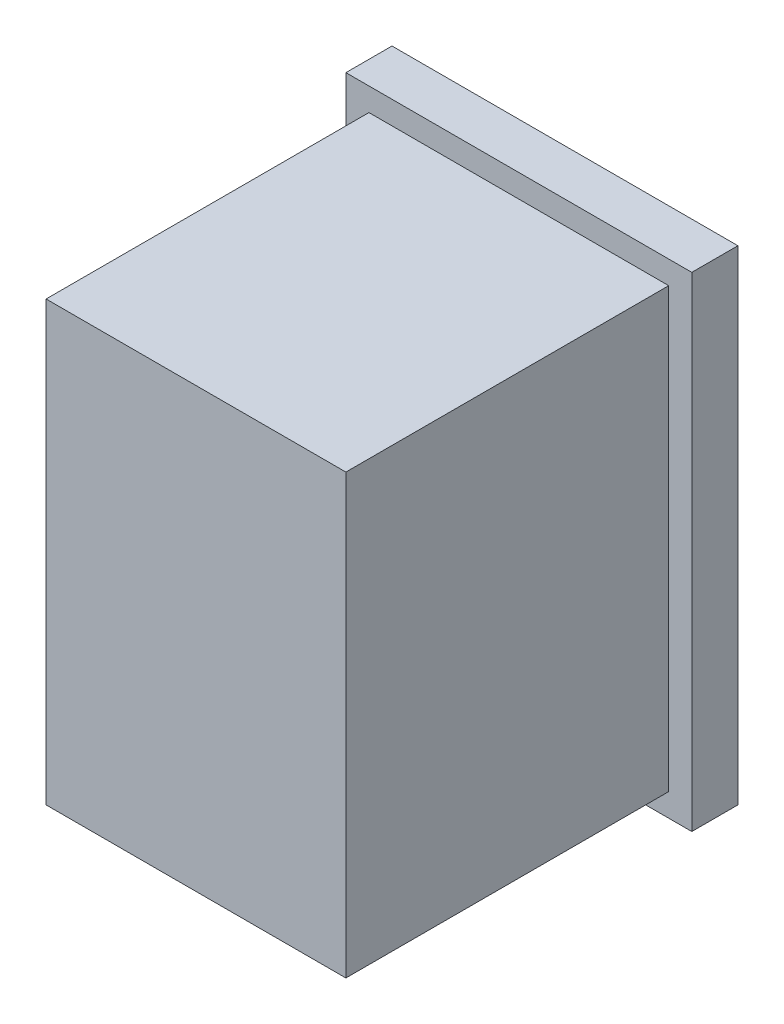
from build123d import *

# Parameters (mm, degrees)
SKETCH_1_W          = 13
SKETCH_1_H          = 19
EXTRUDE_1_DEPTH     = 14
SKETCH_2_W          = 15
SKETCH_2_H          = 21
EXTRUDE_2_DEPTH     = 2
SKETCH_3_W          = 11
SKETCH_3_H          = 16
CUT_EXTRUDE_1_DEPTH = 13
SKETCH_4_W          = 10
SKETCH_4_H          = 7.5
EXTRUDE_3_DEPTH     = 13.5


with BuildPart() as part:
    # Sketch 1 → Extrude 1 (new body)
    with BuildSketch(Plane.XY):
        Rectangle(SKETCH_1_W, SKETCH_1_H)
    extrude(amount=EXTRUDE_1_DEPTH)

    # Sketch 2 → Extrude 2 (add)
    with BuildSketch(Plane(origin=(0, 0, 0), x_dir=(-1, 0, 0), z_dir=(0, 0, -1))):
        Rectangle(SKETCH_2_W, SKETCH_2_H)
    extrude(amount=EXTRUDE_2_DEPTH)

    # Sketch 3 → Cut-Extrude 1 (cut)
    with BuildSketch(Plane(origin=(0, 0, -2), x_dir=(-1, 0, 0), z_dir=(0, 0, -1))):
        Rectangle(SKETCH_3_W, SKETCH_3_H)
    extrude(amount=-CUT_EXTRUDE_1_DEPTH, mode=Mode.SUBTRACT)

    # Sketch 4 → Extrude 3 (add)
    with BuildSketch(Plane(origin=(0, 0, 11), x_dir=(-1, 0, 0), z_dir=(0, 0, -1))):
        with Locations((0, -3.75)):
            Rectangle(SKETCH_4_W, SKETCH_4_H)
    extrude(amount=EXTRUDE_3_DEPTH)


solid = part.part
